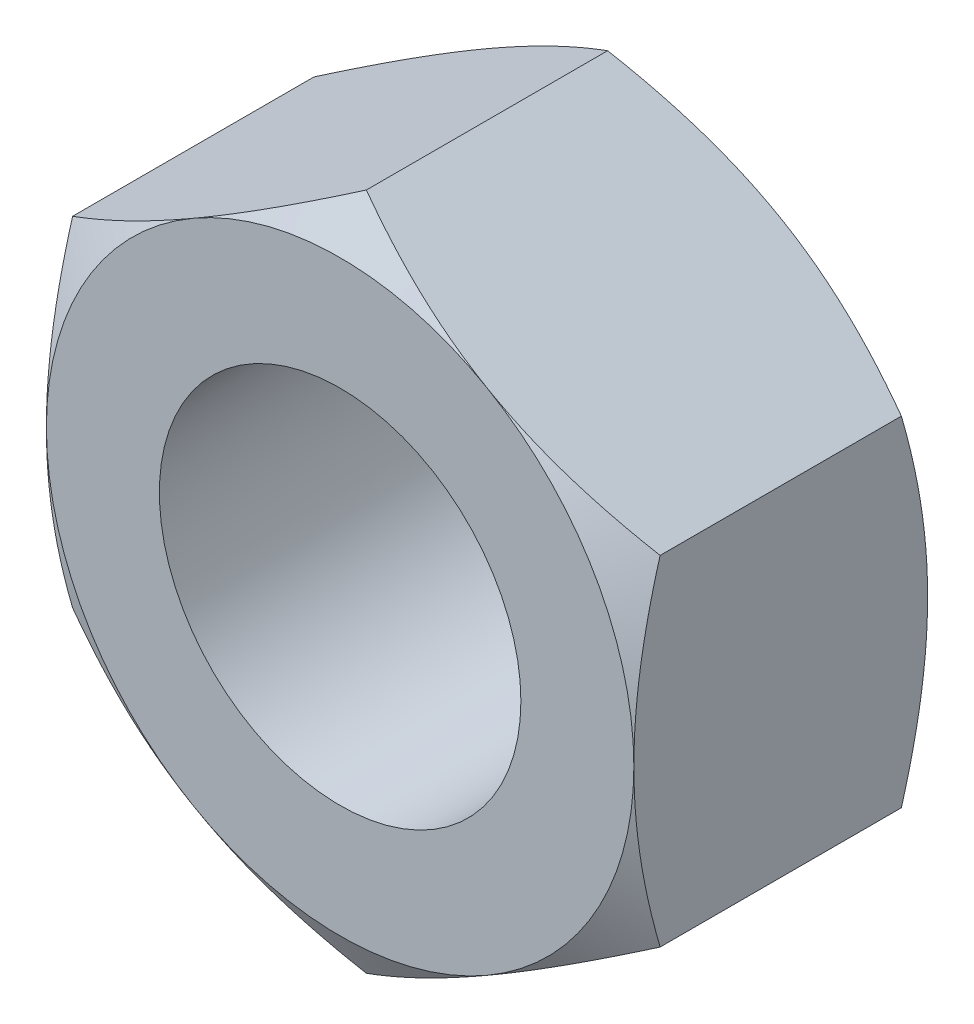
from build123d import *

# Parameters (mm, degrees)
BASE_EXTRUSION_DEPTH    = 6.5
ESQUISSE3_R             = 4
ENL_V_MAT_EXTRU_1_DEPTH = 12.867322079


with BuildPart() as part:
    # Esquisse1 → Base-Extrusion (new body)
    with BuildSketch(Plane.XY):
        Polygon((6.5, -3.75277675), (6.5, 3.75277675), (0, 7.505553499), (-6.5, 3.75277675), (-6.5, -3.75277675), (0, -7.505553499), align=None)
    extrude(amount=-BASE_EXTRUSION_DEPTH)

    # Esquisse2 → Enl_vement de mati_re-R_volution1 (revolve, cut)
    with BuildSketch(Plane(origin=(0, 0, 0), x_dir=(1, 0, 0), z_dir=(0, 1, 0))):
        Polygon((-6.5, 0), (-13.129165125, 0), (-13.129165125, 6.5), (-6.5, 6.5), (-12.129165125, 3.25), align=None)
    revolve(axis=Axis((0, 0, -6.5), (0, 0, 1)), mode=Mode.SUBTRACT)

    # Esquisse3 → Enl_v. mat.-Extru.1 (cut, through all)
    with BuildSketch(Plane.XY):
        Circle(ESQUISSE3_R)
    extrude(amount=-ENL_V_MAT_EXTRU_1_DEPTH, mode=Mode.SUBTRACT)


solid = part.part
